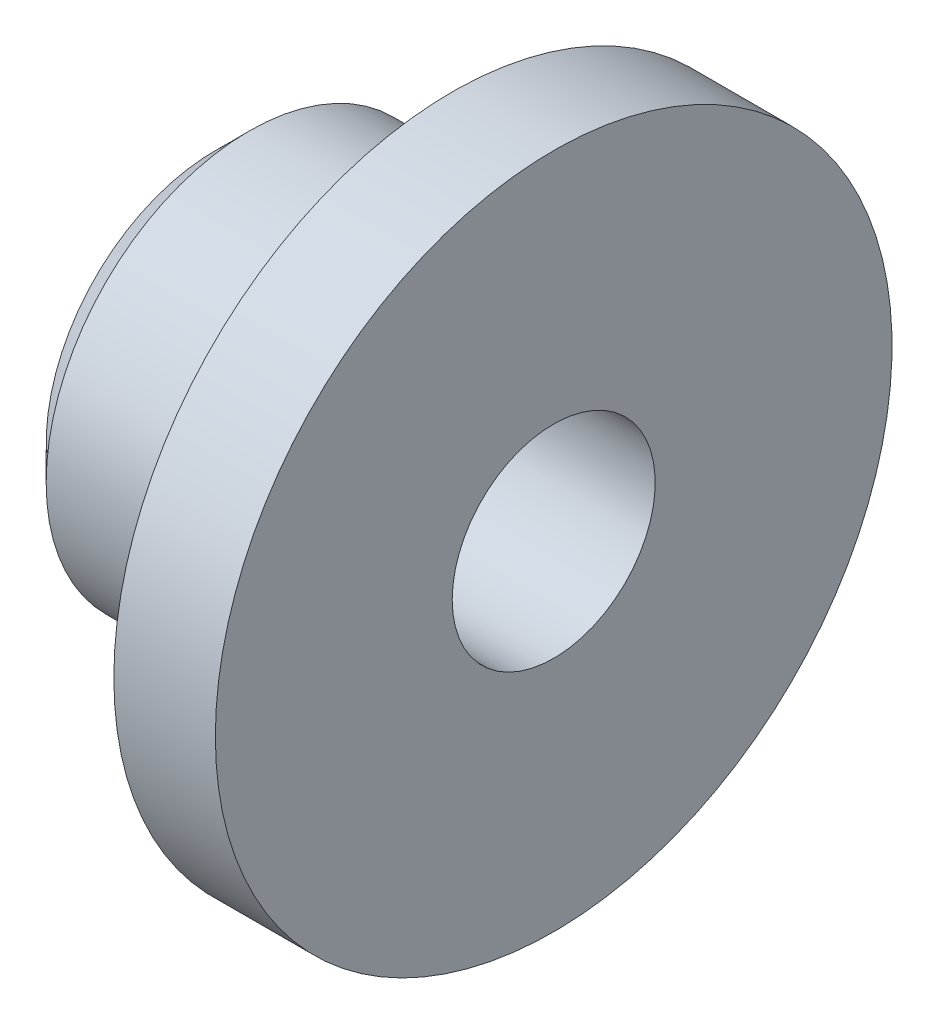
ISO-10303-21;
HEADER;
FILE_DESCRIPTION(('STEP AP214'),'2;1');
FILE_NAME('part.step','',(''),(''),'','','');
FILE_SCHEMA(('AUTOMOTIVE_DESIGN { 1 0 10303 214 1 1 1 1 }'));
ENDSEC;
DATA;
#1=APPLICATION_CONTEXT('core data for automotive mechanical design processes');
#2=APPLICATION_PROTOCOL_DEFINITION('international standard','automotive_design',2000,#1);
#3=PRODUCT_CONTEXT('',#1,'mechanical');
#4=PRODUCT('Part','Part','',(#3));
#5=PRODUCT_RELATED_PRODUCT_CATEGORY('part','',(#4));
#6=PRODUCT_DEFINITION_FORMATION('','',#4);
#7=PRODUCT_DEFINITION_CONTEXT('part definition',#1,'design');
#8=PRODUCT_DEFINITION('design','',#6,#7);
#9=PRODUCT_DEFINITION_SHAPE('','',#8);
#10=(LENGTH_UNIT() NAMED_UNIT(*) SI_UNIT(.MILLI.,.METRE.));
#11=(NAMED_UNIT(*) PLANE_ANGLE_UNIT() SI_UNIT($,.RADIAN.));
#12=(NAMED_UNIT(*) SI_UNIT($,.STERADIAN.) SOLID_ANGLE_UNIT());
#13=UNCERTAINTY_MEASURE_WITH_UNIT(LENGTH_MEASURE(1.E-05),#10,'distance_accuracy_value','');
#14=(GEOMETRIC_REPRESENTATION_CONTEXT(3) GLOBAL_UNCERTAINTY_ASSIGNED_CONTEXT((#13)) GLOBAL_UNIT_ASSIGNED_CONTEXT((#10,
#11,#12)) REPRESENTATION_CONTEXT('',''));
#15=CARTESIAN_POINT('',(0.,0.,0.));
#16=DIRECTION('',(0.,0.,1.));
#17=DIRECTION('',(1.,0.,0.));
#18=AXIS2_PLACEMENT_3D('',#15,#16,#17);
#19=CARTESIAN_POINT('',(-182.472480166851,39.8256182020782,-20.9809897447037));
#20=DIRECTION('',(-1.,0.,0.));
#21=DIRECTION('',(0.,0.,1.));
#22=AXIS2_PLACEMENT_3D('',#19,#20,#21);
#23=CYLINDRICAL_SURFACE('',#22,3.);
#24=CARTESIAN_POINT('',(-181.091924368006,39.8256182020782,-20.9809897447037));
#25=DIRECTION('',(1.,0.,0.));
#26=DIRECTION('',(0.,0.,-1.));
#27=AXIS2_PLACEMENT_3D('',#24,#25,#26);
#28=CIRCLE('',#27,3.);
#29=CARTESIAN_POINT('',(-181.091924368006,39.8256182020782,-23.9809897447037));
#30=VERTEX_POINT('',#29);
#31=EDGE_CURVE('E10',#30,#30,#28,.T.);
#32=ORIENTED_EDGE('',*,*,#31,.T.);
#33=EDGE_LOOP('',(#32));
#34=FACE_BOUND('',#33,.T.);
#35=CARTESIAN_POINT('',(-178.091924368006,39.8256182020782,-20.9809897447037));
#36=DIRECTION('',(-1.,0.,0.));
#37=DIRECTION('',(0.,0.,1.));
#38=AXIS2_PLACEMENT_3D('',#35,#36,#37);
#39=CIRCLE('',#38,3.);
#40=CARTESIAN_POINT('',(-178.091924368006,39.8256182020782,-17.9809897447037));
#41=VERTEX_POINT('',#40);
#42=EDGE_CURVE('E59',#41,#41,#39,.T.);
#43=ORIENTED_EDGE('',*,*,#42,.T.);
#44=EDGE_LOOP('',(#43));
#45=FACE_BOUND('',#44,.T.);
#46=ADVANCED_FACE('F33',(#34,#45),#23,.T.);
#47=CARTESIAN_POINT('',(-181.591924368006,36.8256182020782,-20.9809897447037));
#48=DIRECTION('',(1.,0.,0.));
#49=DIRECTION('',(0.,0.,-1.));
#50=AXIS2_PLACEMENT_3D('',#47,#48,#49);
#51=PLANE('',#50);
#52=CARTESIAN_POINT('',(-181.591924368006,39.8256182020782,-20.9809897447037));
#53=DIRECTION('',(1.,0.,0.));
#54=DIRECTION('',(0.,0.,-1.));
#55=AXIS2_PLACEMENT_3D('',#52,#53,#54);
#56=CIRCLE('',#55,2.50000000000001);
#57=CARTESIAN_POINT('',(-181.591924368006,39.8256182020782,-23.4809897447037));
#58=VERTEX_POINT('',#57);
#59=EDGE_CURVE('E40',#58,#58,#56,.F.);
#60=ORIENTED_EDGE('',*,*,#59,.T.);
#61=EDGE_LOOP('',(#60));
#62=FACE_BOUND('',#61,.T.);
#63=CARTESIAN_POINT('',(-181.591924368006,39.8256182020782,-20.9809897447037));
#64=DIRECTION('',(-1.,0.,0.));
#65=DIRECTION('',(0.,0.,1.));
#66=AXIS2_PLACEMENT_3D('',#63,#64,#65);
#67=CIRCLE('',#66,1.5);
#68=CARTESIAN_POINT('',(-181.591924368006,39.8256182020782,-19.4809897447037));
#69=VERTEX_POINT('',#68);
#70=EDGE_CURVE('E44',#69,#69,#67,.T.);
#71=ORIENTED_EDGE('',*,*,#70,.F.);
#72=EDGE_LOOP('',(#71));
#73=FACE_BOUND('',#72,.T.);
#74=ADVANCED_FACE('F85',(#62,#73),#51,.F.);
#75=CARTESIAN_POINT('',(-182.472480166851,39.8256182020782,-20.9809897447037));
#76=DIRECTION('',(-1.,0.,0.));
#77=DIRECTION('',(0.,0.,1.));
#78=AXIS2_PLACEMENT_3D('',#75,#76,#77);
#79=CYLINDRICAL_SURFACE('',#78,1.5);
#80=CARTESIAN_POINT('',(-176.591924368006,39.8256182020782,-20.9809897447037));
#81=DIRECTION('',(-1.,0.,0.));
#82=DIRECTION('',(0.,0.,1.));
#83=AXIS2_PLACEMENT_3D('',#80,#81,#82);
#84=CIRCLE('',#83,1.5);
#85=CARTESIAN_POINT('',(-176.591924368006,39.8256182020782,-19.4809897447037));
#86=VERTEX_POINT('',#85);
#87=EDGE_CURVE('E48',#86,#86,#84,.T.);
#88=ORIENTED_EDGE('',*,*,#87,.F.);
#89=EDGE_LOOP('',(#88));
#90=FACE_BOUND('',#89,.T.);
#91=ORIENTED_EDGE('',*,*,#70,.T.);
#92=EDGE_LOOP('',(#91));
#93=FACE_BOUND('',#92,.T.);
#94=ADVANCED_FACE('F79',(#90,#93),#79,.F.);
#95=CARTESIAN_POINT('',(-176.591924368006,38.3256182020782,-20.9809897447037));
#96=DIRECTION('',(-1.,0.,0.));
#97=DIRECTION('',(0.,0.,1.));
#98=AXIS2_PLACEMENT_3D('',#95,#96,#97);
#99=PLANE('',#98);
#100=CARTESIAN_POINT('',(-176.591924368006,39.8256182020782,-20.9809897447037));
#101=DIRECTION('',(-1.,0.,0.));
#102=DIRECTION('',(0.,0.,1.));
#103=AXIS2_PLACEMENT_3D('',#100,#101,#102);
#104=CIRCLE('',#103,5.);
#105=CARTESIAN_POINT('',(-176.591924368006,39.8256182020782,-15.9809897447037));
#106=VERTEX_POINT('',#105);
#107=EDGE_CURVE('E53',#106,#106,#104,.T.);
#108=ORIENTED_EDGE('',*,*,#107,.F.);
#109=EDGE_LOOP('',(#108));
#110=FACE_BOUND('',#109,.T.);
#111=ORIENTED_EDGE('',*,*,#87,.T.);
#112=EDGE_LOOP('',(#111));
#113=FACE_BOUND('',#112,.T.);
#114=ADVANCED_FACE('F73',(#110,#113),#99,.F.);
#115=CARTESIAN_POINT('',(-182.472480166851,39.8256182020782,-20.9809897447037));
#116=DIRECTION('',(-1.,0.,0.));
#117=DIRECTION('',(0.,0.,1.));
#118=AXIS2_PLACEMENT_3D('',#115,#116,#117);
#119=CYLINDRICAL_SURFACE('',#118,5.);
#120=CARTESIAN_POINT('',(-178.091924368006,39.8256182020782,-20.9809897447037));
#121=DIRECTION('',(-1.,0.,0.));
#122=DIRECTION('',(0.,0.,1.));
#123=AXIS2_PLACEMENT_3D('',#120,#121,#122);
#124=CIRCLE('',#123,5.);
#125=CARTESIAN_POINT('',(-178.091924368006,39.8256182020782,-15.9809897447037));
#126=VERTEX_POINT('',#125);
#127=EDGE_CURVE('E56',#126,#126,#124,.T.);
#128=ORIENTED_EDGE('',*,*,#127,.F.);
#129=EDGE_LOOP('',(#128));
#130=FACE_BOUND('',#129,.T.);
#131=ORIENTED_EDGE('',*,*,#107,.T.);
#132=EDGE_LOOP('',(#131));
#133=FACE_BOUND('',#132,.T.);
#134=ADVANCED_FACE('F67',(#130,#133),#119,.T.);
#135=CARTESIAN_POINT('',(-178.091924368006,36.8256182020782,-20.9809897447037));
#136=DIRECTION('',(1.,0.,0.));
#137=DIRECTION('',(0.,0.,-1.));
#138=AXIS2_PLACEMENT_3D('',#135,#136,#137);
#139=PLANE('',#138);
#140=ORIENTED_EDGE('',*,*,#42,.F.);
#141=EDGE_LOOP('',(#140));
#142=FACE_BOUND('',#141,.T.);
#143=ORIENTED_EDGE('',*,*,#127,.T.);
#144=EDGE_LOOP('',(#143));
#145=FACE_BOUND('',#144,.T.);
#146=ADVANCED_FACE('F64',(#142,#145),#139,.F.);
#147=CARTESIAN_POINT('',(-181.591924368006,39.8256182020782,-20.9809897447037));
#148=DIRECTION('',(1.,0.,0.));
#149=DIRECTION('',(0.,0.,-1.));
#150=AXIS2_PLACEMENT_3D('',#147,#148,#149);
#151=CONICAL_SURFACE('',#150,2.50000000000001,0.785398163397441);
#152=ORIENTED_EDGE('',*,*,#31,.F.);
#153=EDGE_LOOP('',(#152));
#154=FACE_BOUND('',#153,.T.);
#155=ORIENTED_EDGE('',*,*,#59,.F.);
#156=EDGE_LOOP('',(#155));
#157=FACE_BOUND('',#156,.T.);
#158=ADVANCED_FACE('F35',(#154,#157),#151,.T.);
#159=CLOSED_SHELL('',(#46,#74,#94,#114,#134,#146,#158));
#160=MANIFOLD_SOLID_BREP('B2',#159);
#161=ADVANCED_BREP_SHAPE_REPRESENTATION('',(#18,#160),#14);
#162=SHAPE_DEFINITION_REPRESENTATION(#9,#161);
ENDSEC;
END-ISO-10303-21;
